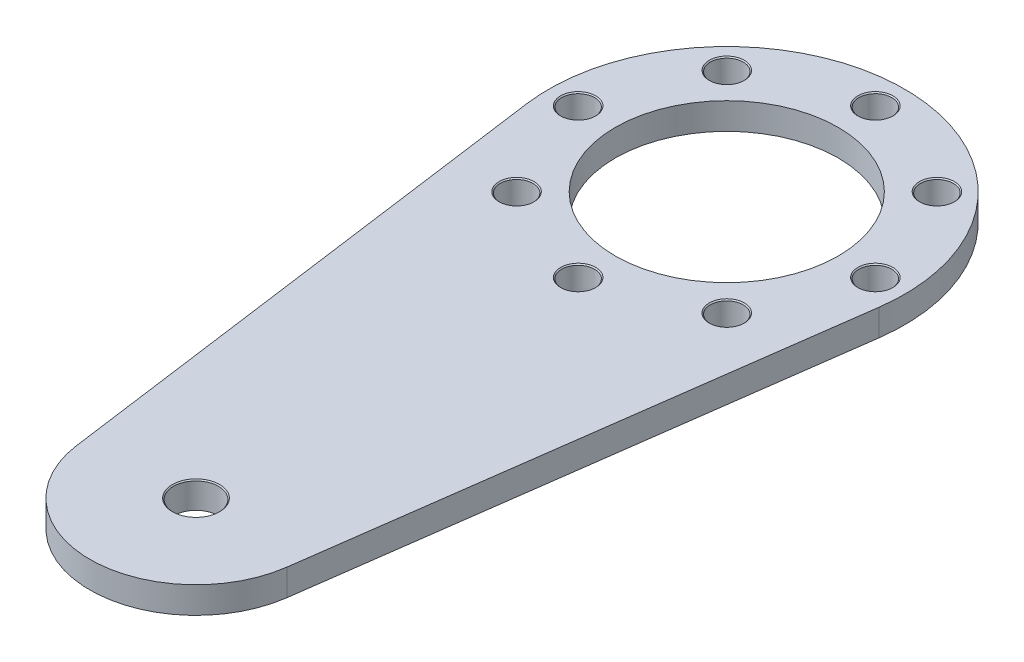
from build123d import *

# Parameters (mm, degrees)
SKETCH1_R                            = 21
BOSS_EXTRUDE1_DEPTH                  = 5
F_8_5_8_5_DIAMETER_HOLE1_D           = 8.5
F_8_5_8_5_DIAMETER_HOLE1_DEPTH       = 26
F_8_5_8_5_DIAMETER_HOLE1_CSINK_D     = 8.9
F_8_5_8_5_DIAMETER_HOLE1_CSINK_ANGLE = 90
F_8_5_8_5_DIAMETER_HOLE1_TIP         = 2.553657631
CIRPATTERN1_COUNT                    = 8


with BuildPart() as part:
    # Sketch1 → Boss-Extrude1 (new body)
    with BuildSketch(Plane(origin=(0, 0, 0), x_dir=(1, 0, 0), z_dir=(0, 1, 0))):
        with BuildLine():
            Line((-33.193327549, -4.5225), (-19.816911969, -102.7))
            ThreePointArc((-19.816911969, -102.7), (0, -120), (19.816911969, -102.7))
            Line((19.816911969, -102.7), (33.193327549, -4.5225))
            ThreePointArc((33.193327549, -4.5225), (0, 33.5), (-33.193327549, -4.5225))
        make_face()
        with Locations(Location((0, 0, 0), (0, 0, 270))):
            Circle(SKETCH1_R, mode=Mode.SUBTRACT)
    extrude(amount=BOSS_EXTRUDE1_DEPTH)

    # 8.5 _8.5_ Diameter Hole1
    with Locations(Plane(origin=(0, 5, 0), x_dir=(1, 0, 0), z_dir=(0, 1, 0))):
        with Locations((0, -100)):
            CounterSinkHole(F_8_5_8_5_DIAMETER_HOLE1_D / 2, F_8_5_8_5_DIAMETER_HOLE1_CSINK_D / 2, depth=F_8_5_8_5_DIAMETER_HOLE1_DEPTH, counter_sink_angle=F_8_5_8_5_DIAMETER_HOLE1_CSINK_ANGLE)
            with Locations((0, 0, -(F_8_5_8_5_DIAMETER_HOLE1_DEPTH + F_8_5_8_5_DIAMETER_HOLE1_TIP / 2))):  # 118° drill point
                Cone(0, F_8_5_8_5_DIAMETER_HOLE1_D / 2, F_8_5_8_5_DIAMETER_HOLE1_TIP, mode=Mode.SUBTRACT)

    # Sketch6 → 6.2 _6.2_ Diameter Hole1 (revolve, cut)
    with BuildSketch(Plane(origin=(0, 5, 28), x_dir=(0, 0, 1), z_dir=(1, 0, 0))):
        Polygon((0, 0), (0, 27.862667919), (3.1, 26), (3.1, 0.2), (3.3, 0), align=None)
    f_6_2_6_2_diameter_hole1 = revolve(axis=Axis((0, 11.35, 28), (0, -1, 0)), mode=Mode.SUBTRACT)

    # CirPattern1: 6.2 _6.2_ Diameter Hole1 ×8 about axis
    cirpattern1_axis = Axis((0, 0, 0), (0, 1, 0))
    for i in range(1, CIRPATTERN1_COUNT):
        add(f_6_2_6_2_diameter_hole1.rotate(cirpattern1_axis, i * 360 / CIRPATTERN1_COUNT), mode=Mode.SUBTRACT)


solid = part.part
